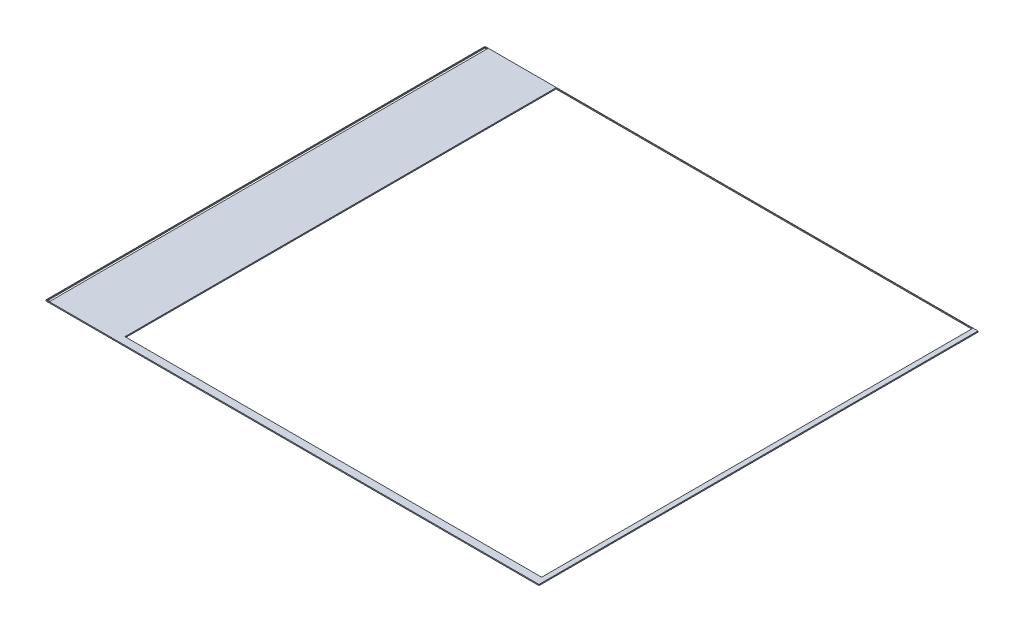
from build123d import *

# Parameters (mm, degrees)
SKETCH1_W          = 22.73
SKETCH1_H          = 20.24
EXTRUDE1_DEPTH     = 0.05
SKETCH2_W          = 0.13
SKETCH2_H          = 20.185
CUT_EXTRUDE1_DEPTH = 16.217756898
SKETCH3_W          = 19.2096
SKETCH3_H          = 19.872
CUT_EXTRUDE2_DEPTH = 16.217756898


with BuildPart() as part:
    # Sketch1 → Extrude1 (new body)
    with BuildSketch(Plane(origin=(0, 0, 0), x_dir=(1, 0, 0), z_dir=(0, 1, 0))):
        Rectangle(SKETCH1_W, SKETCH1_H)
    extrude(amount=EXTRUDE1_DEPTH)

    # Sketch2 → Cut-Extrude1 (cut, through all)
    with BuildSketch(Plane.XZ):
        with Locations((-11.2796, -0.00435)):
            Rectangle(SKETCH2_W, SKETCH2_H)
    extrude(amount=-CUT_EXTRUDE1_DEPTH, mode=Mode.SUBTRACT)

    # Sketch3 → Cut-Extrude2 (cut, through all)
    with BuildSketch(Plane.XZ):
        with Locations((1.533, -0.165375)):
            Rectangle(SKETCH3_W, SKETCH3_H)
    extrude(amount=-CUT_EXTRUDE2_DEPTH, mode=Mode.SUBTRACT)


solid = part.part
